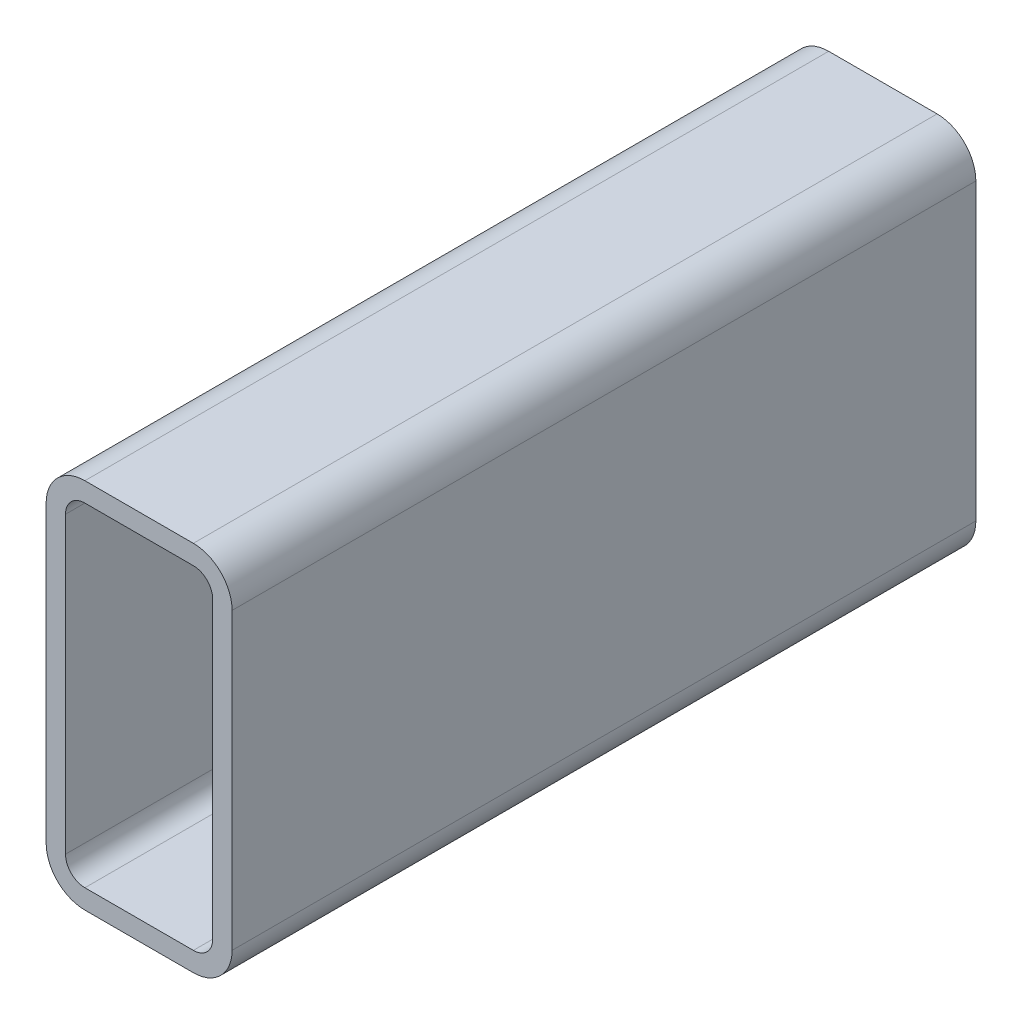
ISO-10303-21;
HEADER;
FILE_DESCRIPTION(('STEP AP214'),'2;1');
FILE_NAME('part.step','',(''),(''),'','','');
FILE_SCHEMA(('AUTOMOTIVE_DESIGN { 1 0 10303 214 1 1 1 1 }'));
ENDSEC;
DATA;
#1=APPLICATION_CONTEXT('core data for automotive mechanical design processes');
#2=APPLICATION_PROTOCOL_DEFINITION('international standard','automotive_design',2000,#1);
#3=PRODUCT_CONTEXT('',#1,'mechanical');
#4=PRODUCT('Part','Part','',(#3));
#5=PRODUCT_RELATED_PRODUCT_CATEGORY('part','',(#4));
#6=PRODUCT_DEFINITION_FORMATION('','',#4);
#7=PRODUCT_DEFINITION_CONTEXT('part definition',#1,'design');
#8=PRODUCT_DEFINITION('design','',#6,#7);
#9=PRODUCT_DEFINITION_SHAPE('','',#8);
#10=(LENGTH_UNIT() NAMED_UNIT(*) SI_UNIT(.MILLI.,.METRE.));
#11=(NAMED_UNIT(*) PLANE_ANGLE_UNIT() SI_UNIT($,.RADIAN.));
#12=(NAMED_UNIT(*) SI_UNIT($,.STERADIAN.) SOLID_ANGLE_UNIT());
#13=UNCERTAINTY_MEASURE_WITH_UNIT(LENGTH_MEASURE(1.E-05),#10,'distance_accuracy_value','');
#14=(GEOMETRIC_REPRESENTATION_CONTEXT(3) GLOBAL_UNCERTAINTY_ASSIGNED_CONTEXT((#13)) GLOBAL_UNIT_ASSIGNED_CONTEXT((#10,
#11,#12)) REPRESENTATION_CONTEXT('',''));
#15=CARTESIAN_POINT('',(0.,0.,0.));
#16=DIRECTION('',(0.,0.,1.));
#17=DIRECTION('',(1.,0.,0.));
#18=AXIS2_PLACEMENT_3D('',#15,#16,#17);
#19=CARTESIAN_POINT('',(18.3641160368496,138.536948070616,304.8));
#20=DIRECTION('',(0.,0.,1.));
#21=DIRECTION('',(1.,0.,0.));
#22=AXIS2_PLACEMENT_3D('',#19,#20,#21);
#23=PLANE('',#22);
#24=CARTESIAN_POINT('',(18.3641160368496,138.536948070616,304.8));
#25=DIRECTION('',(0.,0.,1.));
#26=DIRECTION('',(1.,0.,0.));
#27=AXIS2_PLACEMENT_3D('',#24,#25,#26);
#28=CIRCLE('',#27,15.875);
#29=CARTESIAN_POINT('',(18.3641160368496,154.411948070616,304.8));
#30=VERTEX_POINT('',#29);
#31=CARTESIAN_POINT('',(2.48911603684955,138.536948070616,304.8));
#32=VERTEX_POINT('',#31);
#33=EDGE_CURVE('E211',#30,#32,#28,.T.);
#34=ORIENTED_EDGE('',*,*,#33,.T.);
#35=DIRECTION('',(0.,-1.,0.));
#36=VECTOR('',#35,1.);
#37=CARTESIAN_POINT('',(2.48911603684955,17.8869480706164,304.8));
#38=LINE('',#37,#36);
#39=CARTESIAN_POINT('',(2.48911603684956,17.8869480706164,304.8));
#40=VERTEX_POINT('',#39);
#41=EDGE_CURVE('E214',#32,#40,#38,.T.);
#42=ORIENTED_EDGE('',*,*,#41,.T.);
#43=CARTESIAN_POINT('',(18.3641160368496,17.8869480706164,304.8));
#44=DIRECTION('',(0.,0.,1.));
#45=DIRECTION('',(1.,0.,0.));
#46=AXIS2_PLACEMENT_3D('',#43,#44,#45);
#47=CIRCLE('',#46,15.875);
#48=CARTESIAN_POINT('',(18.3641160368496,2.01194807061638,304.8));
#49=VERTEX_POINT('',#48);
#50=EDGE_CURVE('E217',#40,#49,#47,.T.);
#51=ORIENTED_EDGE('',*,*,#50,.T.);
#52=DIRECTION('',(1.,0.,0.));
#53=VECTOR('',#52,1.);
#54=CARTESIAN_POINT('',(62.8141160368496,2.01194807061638,304.8));
#55=LINE('',#54,#53);
#56=CARTESIAN_POINT('',(62.8141160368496,2.01194807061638,304.8));
#57=VERTEX_POINT('',#56);
#58=EDGE_CURVE('E219',#49,#57,#55,.T.);
#59=ORIENTED_EDGE('',*,*,#58,.T.);
#60=CARTESIAN_POINT('',(62.8141160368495,17.8869480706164,304.8));
#61=DIRECTION('',(0.,0.,1.));
#62=DIRECTION('',(1.,0.,0.));
#63=AXIS2_PLACEMENT_3D('',#60,#61,#62);
#64=CIRCLE('',#63,15.875);
#65=CARTESIAN_POINT('',(78.6891160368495,17.8869480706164,304.8));
#66=VERTEX_POINT('',#65);
#67=EDGE_CURVE('E221',#57,#66,#64,.T.);
#68=ORIENTED_EDGE('',*,*,#67,.T.);
#69=DIRECTION('',(0.,1.,0.));
#70=VECTOR('',#69,1.);
#71=CARTESIAN_POINT('',(78.6891160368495,138.536948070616,304.8));
#72=LINE('',#71,#70);
#73=CARTESIAN_POINT('',(78.6891160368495,138.536948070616,304.8));
#74=VERTEX_POINT('',#73);
#75=EDGE_CURVE('E223',#66,#74,#72,.T.);
#76=ORIENTED_EDGE('',*,*,#75,.T.);
#77=CARTESIAN_POINT('',(62.8141160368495,138.536948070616,304.8));
#78=DIRECTION('',(0.,0.,1.));
#79=DIRECTION('',(1.,0.,0.));
#80=AXIS2_PLACEMENT_3D('',#77,#78,#79);
#81=CIRCLE('',#80,15.875);
#82=CARTESIAN_POINT('',(62.8141160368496,154.411948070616,304.8));
#83=VERTEX_POINT('',#82);
#84=EDGE_CURVE('E225',#74,#83,#81,.T.);
#85=ORIENTED_EDGE('',*,*,#84,.T.);
#86=DIRECTION('',(-1.,0.,0.));
#87=VECTOR('',#86,1.);
#88=CARTESIAN_POINT('',(18.3641160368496,154.411948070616,304.8));
#89=LINE('',#88,#87);
#90=EDGE_CURVE('E227',#83,#30,#89,.T.);
#91=ORIENTED_EDGE('',*,*,#90,.T.);
#92=EDGE_LOOP('',(#34,#42,#51,#59,#68,#76,#85,#91));
#93=FACE_BOUND('',#92,.T.);
#94=DIRECTION('',(0.,-1.,0.));
#95=VECTOR('',#94,1.);
#96=CARTESIAN_POINT('',(10.4266160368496,17.8869480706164,304.8));
#97=LINE('',#96,#95);
#98=CARTESIAN_POINT('',(10.4266160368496,138.536948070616,304.8));
#99=VERTEX_POINT('',#98);
#100=CARTESIAN_POINT('',(10.4266160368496,17.8869480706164,304.8));
#101=VERTEX_POINT('',#100);
#102=EDGE_CURVE('E154',#99,#101,#97,.T.);
#103=ORIENTED_EDGE('',*,*,#102,.F.);
#104=CARTESIAN_POINT('',(18.3641160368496,138.536948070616,304.8));
#105=DIRECTION('',(0.,0.,1.));
#106=DIRECTION('',(1.,0.,0.));
#107=AXIS2_PLACEMENT_3D('',#104,#105,#106);
#108=CIRCLE('',#107,7.93750000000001);
#109=CARTESIAN_POINT('',(18.3641160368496,146.474448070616,304.8));
#110=VERTEX_POINT('',#109);
#111=EDGE_CURVE('E146',#110,#99,#108,.T.);
#112=ORIENTED_EDGE('',*,*,#111,.F.);
#113=DIRECTION('',(-1.,0.,0.));
#114=VECTOR('',#113,1.);
#115=CARTESIAN_POINT('',(18.3641160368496,146.474448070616,304.8));
#116=LINE('',#115,#114);
#117=CARTESIAN_POINT('',(62.8141160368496,146.474448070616,304.8));
#118=VERTEX_POINT('',#117);
#119=EDGE_CURVE('E179',#118,#110,#116,.T.);
#120=ORIENTED_EDGE('',*,*,#119,.F.);
#121=CARTESIAN_POINT('',(62.8141160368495,138.536948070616,304.8));
#122=DIRECTION('',(0.,0.,1.));
#123=DIRECTION('',(1.,0.,0.));
#124=AXIS2_PLACEMENT_3D('',#121,#122,#123);
#125=CIRCLE('',#124,7.93750000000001);
#126=CARTESIAN_POINT('',(70.7516160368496,138.536948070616,304.8));
#127=VERTEX_POINT('',#126);
#128=EDGE_CURVE('E177',#127,#118,#125,.T.);
#129=ORIENTED_EDGE('',*,*,#128,.F.);
#130=DIRECTION('',(0.,1.,0.));
#131=VECTOR('',#130,1.);
#132=CARTESIAN_POINT('',(70.7516160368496,138.536948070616,304.8));
#133=LINE('',#132,#131);
#134=CARTESIAN_POINT('',(70.7516160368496,17.8869480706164,304.8));
#135=VERTEX_POINT('',#134);
#136=EDGE_CURVE('E175',#135,#127,#133,.T.);
#137=ORIENTED_EDGE('',*,*,#136,.F.);
#138=CARTESIAN_POINT('',(62.8141160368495,17.8869480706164,304.8));
#139=DIRECTION('',(0.,0.,1.));
#140=DIRECTION('',(1.,0.,0.));
#141=AXIS2_PLACEMENT_3D('',#138,#139,#140);
#142=CIRCLE('',#141,7.9375);
#143=CARTESIAN_POINT('',(62.8141160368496,9.94944807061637,304.8));
#144=VERTEX_POINT('',#143);
#145=EDGE_CURVE('E173',#144,#135,#142,.T.);
#146=ORIENTED_EDGE('',*,*,#145,.F.);
#147=DIRECTION('',(1.,0.,0.));
#148=VECTOR('',#147,1.);
#149=CARTESIAN_POINT('',(62.8141160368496,9.94944807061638,304.8));
#150=LINE('',#149,#148);
#151=CARTESIAN_POINT('',(18.3641160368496,9.94944807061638,304.8));
#152=VERTEX_POINT('',#151);
#153=EDGE_CURVE('E169',#152,#144,#150,.T.);
#154=ORIENTED_EDGE('',*,*,#153,.F.);
#155=CARTESIAN_POINT('',(18.3641160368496,17.8869480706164,304.8));
#156=DIRECTION('',(0.,0.,1.));
#157=DIRECTION('',(1.,0.,0.));
#158=AXIS2_PLACEMENT_3D('',#155,#156,#157);
#159=CIRCLE('',#158,7.9375);
#160=EDGE_CURVE('E167',#101,#152,#159,.T.);
#161=ORIENTED_EDGE('',*,*,#160,.F.);
#162=EDGE_LOOP('',(#103,#112,#120,#129,#137,#146,#154,#161));
#163=FACE_BOUND('',#162,.T.);
#164=ADVANCED_FACE('F33',(#93,#163),#23,.T.);
#165=CARTESIAN_POINT('',(18.3641160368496,138.536948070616,0.));
#166=DIRECTION('',(0.,0.,1.));
#167=DIRECTION('',(1.,0.,0.));
#168=AXIS2_PLACEMENT_3D('',#165,#166,#167);
#169=PLANE('',#168);
#170=CARTESIAN_POINT('',(18.3641160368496,138.536948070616,0.));
#171=DIRECTION('',(0.,0.,1.));
#172=DIRECTION('',(1.,0.,0.));
#173=AXIS2_PLACEMENT_3D('',#170,#171,#172);
#174=CIRCLE('',#173,15.875);
#175=CARTESIAN_POINT('',(18.3641160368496,154.411948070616,0.));
#176=VERTEX_POINT('',#175);
#177=CARTESIAN_POINT('',(2.48911603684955,138.536948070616,0.));
#178=VERTEX_POINT('',#177);
#179=EDGE_CURVE('E162',#176,#178,#174,.T.);
#180=ORIENTED_EDGE('',*,*,#179,.F.);
#181=DIRECTION('',(-1.,0.,0.));
#182=VECTOR('',#181,1.);
#183=CARTESIAN_POINT('',(18.3641160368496,154.411948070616,0.));
#184=LINE('',#183,#182);
#185=CARTESIAN_POINT('',(62.8141160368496,154.411948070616,0.));
#186=VERTEX_POINT('',#185);
#187=EDGE_CURVE('E215',#186,#176,#184,.T.);
#188=ORIENTED_EDGE('',*,*,#187,.F.);
#189=CARTESIAN_POINT('',(62.8141160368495,138.536948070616,0.));
#190=DIRECTION('',(0.,0.,1.));
#191=DIRECTION('',(1.,0.,0.));
#192=AXIS2_PLACEMENT_3D('',#189,#190,#191);
#193=CIRCLE('',#192,15.875);
#194=CARTESIAN_POINT('',(78.6891160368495,138.536948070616,0.));
#195=VERTEX_POINT('',#194);
#196=EDGE_CURVE('E242',#195,#186,#193,.T.);
#197=ORIENTED_EDGE('',*,*,#196,.F.);
#198=DIRECTION('',(0.,1.,0.));
#199=VECTOR('',#198,1.);
#200=CARTESIAN_POINT('',(78.6891160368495,138.536948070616,0.));
#201=LINE('',#200,#199);
#202=CARTESIAN_POINT('',(78.6891160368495,17.8869480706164,0.));
#203=VERTEX_POINT('',#202);
#204=EDGE_CURVE('E240',#203,#195,#201,.T.);
#205=ORIENTED_EDGE('',*,*,#204,.F.);
#206=CARTESIAN_POINT('',(62.8141160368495,17.8869480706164,0.));
#207=DIRECTION('',(0.,0.,1.));
#208=DIRECTION('',(1.,0.,0.));
#209=AXIS2_PLACEMENT_3D('',#206,#207,#208);
#210=CIRCLE('',#209,15.875);
#211=CARTESIAN_POINT('',(62.8141160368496,2.01194807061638,0.));
#212=VERTEX_POINT('',#211);
#213=EDGE_CURVE('E238',#212,#203,#210,.T.);
#214=ORIENTED_EDGE('',*,*,#213,.F.);
#215=DIRECTION('',(1.,0.,0.));
#216=VECTOR('',#215,1.);
#217=CARTESIAN_POINT('',(62.8141160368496,2.01194807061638,0.));
#218=LINE('',#217,#216);
#219=CARTESIAN_POINT('',(18.3641160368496,2.01194807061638,0.));
#220=VERTEX_POINT('',#219);
#221=EDGE_CURVE('E236',#220,#212,#218,.T.);
#222=ORIENTED_EDGE('',*,*,#221,.F.);
#223=CARTESIAN_POINT('',(18.3641160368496,17.8869480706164,0.));
#224=DIRECTION('',(0.,0.,1.));
#225=DIRECTION('',(1.,0.,0.));
#226=AXIS2_PLACEMENT_3D('',#223,#224,#225);
#227=CIRCLE('',#226,15.875);
#228=CARTESIAN_POINT('',(2.48911603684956,17.8869480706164,0.));
#229=VERTEX_POINT('',#228);
#230=EDGE_CURVE('E234',#229,#220,#227,.T.);
#231=ORIENTED_EDGE('',*,*,#230,.F.);
#232=DIRECTION('',(0.,-1.,0.));
#233=VECTOR('',#232,1.);
#234=CARTESIAN_POINT('',(2.48911603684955,17.8869480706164,0.));
#235=LINE('',#234,#233);
#236=EDGE_CURVE('E232',#178,#229,#235,.T.);
#237=ORIENTED_EDGE('',*,*,#236,.F.);
#238=EDGE_LOOP('',(#180,#188,#197,#205,#214,#222,#231,#237));
#239=FACE_BOUND('',#238,.T.);
#240=CARTESIAN_POINT('',(18.3641160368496,138.536948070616,0.));
#241=DIRECTION('',(0.,0.,1.));
#242=DIRECTION('',(1.,0.,0.));
#243=AXIS2_PLACEMENT_3D('',#240,#241,#242);
#244=CIRCLE('',#243,7.93750000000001);
#245=CARTESIAN_POINT('',(18.3641160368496,146.474448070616,0.));
#246=VERTEX_POINT('',#245);
#247=CARTESIAN_POINT('',(10.4266160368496,138.536948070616,0.));
#248=VERTEX_POINT('',#247);
#249=EDGE_CURVE('E56',#246,#248,#244,.T.);
#250=ORIENTED_EDGE('',*,*,#249,.T.);
#251=DIRECTION('',(0.,-1.,0.));
#252=VECTOR('',#251,1.);
#253=CARTESIAN_POINT('',(10.4266160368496,17.8869480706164,0.));
#254=LINE('',#253,#252);
#255=CARTESIAN_POINT('',(10.4266160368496,17.8869480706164,0.));
#256=VERTEX_POINT('',#255);
#257=EDGE_CURVE('E161',#248,#256,#254,.T.);
#258=ORIENTED_EDGE('',*,*,#257,.T.);
#259=CARTESIAN_POINT('',(18.3641160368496,17.8869480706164,0.));
#260=DIRECTION('',(0.,0.,1.));
#261=DIRECTION('',(1.,0.,0.));
#262=AXIS2_PLACEMENT_3D('',#259,#260,#261);
#263=CIRCLE('',#262,7.9375);
#264=CARTESIAN_POINT('',(18.3641160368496,9.94944807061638,0.));
#265=VERTEX_POINT('',#264);
#266=EDGE_CURVE('E183',#256,#265,#263,.T.);
#267=ORIENTED_EDGE('',*,*,#266,.T.);
#268=DIRECTION('',(1.,0.,0.));
#269=VECTOR('',#268,1.);
#270=CARTESIAN_POINT('',(62.8141160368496,9.94944807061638,0.));
#271=LINE('',#270,#269);
#272=CARTESIAN_POINT('',(62.8141160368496,9.94944807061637,0.));
#273=VERTEX_POINT('',#272);
#274=EDGE_CURVE('E186',#265,#273,#271,.T.);
#275=ORIENTED_EDGE('',*,*,#274,.T.);
#276=CARTESIAN_POINT('',(62.8141160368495,17.8869480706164,0.));
#277=DIRECTION('',(0.,0.,1.));
#278=DIRECTION('',(1.,0.,0.));
#279=AXIS2_PLACEMENT_3D('',#276,#277,#278);
#280=CIRCLE('',#279,7.9375);
#281=CARTESIAN_POINT('',(70.7516160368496,17.8869480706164,0.));
#282=VERTEX_POINT('',#281);
#283=EDGE_CURVE('E189',#273,#282,#280,.T.);
#284=ORIENTED_EDGE('',*,*,#283,.T.);
#285=DIRECTION('',(0.,1.,0.));
#286=VECTOR('',#285,1.);
#287=CARTESIAN_POINT('',(70.7516160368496,138.536948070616,0.));
#288=LINE('',#287,#286);
#289=CARTESIAN_POINT('',(70.7516160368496,138.536948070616,0.));
#290=VERTEX_POINT('',#289);
#291=EDGE_CURVE('E192',#282,#290,#288,.T.);
#292=ORIENTED_EDGE('',*,*,#291,.T.);
#293=CARTESIAN_POINT('',(62.8141160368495,138.536948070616,0.));
#294=DIRECTION('',(0.,0.,1.));
#295=DIRECTION('',(1.,0.,0.));
#296=AXIS2_PLACEMENT_3D('',#293,#294,#295);
#297=CIRCLE('',#296,7.93750000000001);
#298=CARTESIAN_POINT('',(62.8141160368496,146.474448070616,0.));
#299=VERTEX_POINT('',#298);
#300=EDGE_CURVE('E195',#290,#299,#297,.T.);
#301=ORIENTED_EDGE('',*,*,#300,.T.);
#302=DIRECTION('',(-1.,0.,0.));
#303=VECTOR('',#302,1.);
#304=CARTESIAN_POINT('',(18.3641160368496,146.474448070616,0.));
#305=LINE('',#304,#303);
#306=EDGE_CURVE('E155',#299,#246,#305,.T.);
#307=ORIENTED_EDGE('',*,*,#306,.T.);
#308=EDGE_LOOP('',(#250,#258,#267,#275,#284,#292,#301,#307));
#309=FACE_BOUND('',#308,.T.);
#310=ADVANCED_FACE('F272',(#239,#309),#169,.F.);
#311=CARTESIAN_POINT('',(18.3641160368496,138.536948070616,304.8));
#312=DIRECTION('',(0.,0.,-1.));
#313=DIRECTION('',(-1.,0.,0.));
#314=AXIS2_PLACEMENT_3D('',#311,#312,#313);
#315=CYLINDRICAL_SURFACE('',#314,15.875);
#316=ORIENTED_EDGE('',*,*,#179,.T.);
#317=DIRECTION('',(0.,0.,-1.));
#318=VECTOR('',#317,1.);
#319=CARTESIAN_POINT('',(2.48911603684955,138.536948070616,304.8));
#320=LINE('',#319,#318);
#321=EDGE_CURVE('E11',#32,#178,#320,.T.);
#322=ORIENTED_EDGE('',*,*,#321,.F.);
#323=ORIENTED_EDGE('',*,*,#33,.F.);
#324=DIRECTION('',(0.,0.,-1.));
#325=VECTOR('',#324,1.);
#326=CARTESIAN_POINT('',(18.3641160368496,154.411948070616,304.8));
#327=LINE('',#326,#325);
#328=EDGE_CURVE('E229',#30,#176,#327,.T.);
#329=ORIENTED_EDGE('',*,*,#328,.T.);
#330=EDGE_LOOP('',(#316,#322,#323,#329));
#331=FACE_BOUND('',#330,.T.);
#332=ADVANCED_FACE('F35',(#331),#315,.T.);
#333=CARTESIAN_POINT('',(2.48911603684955,17.8869480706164,304.8));
#334=DIRECTION('',(1.,0.,0.));
#335=DIRECTION('',(0.,0.,-1.));
#336=AXIS2_PLACEMENT_3D('',#333,#334,#335);
#337=PLANE('',#336);
#338=ORIENTED_EDGE('',*,*,#236,.T.);
#339=DIRECTION('',(0.,0.,-1.));
#340=VECTOR('',#339,1.);
#341=CARTESIAN_POINT('',(2.48911603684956,17.8869480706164,304.8));
#342=LINE('',#341,#340);
#343=EDGE_CURVE('E41',#40,#229,#342,.T.);
#344=ORIENTED_EDGE('',*,*,#343,.F.);
#345=ORIENTED_EDGE('',*,*,#41,.F.);
#346=ORIENTED_EDGE('',*,*,#321,.T.);
#347=EDGE_LOOP('',(#338,#344,#345,#346));
#348=FACE_BOUND('',#347,.T.);
#349=ADVANCED_FACE('F289',(#348),#337,.F.);
#350=CARTESIAN_POINT('',(18.3641160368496,17.8869480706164,304.8));
#351=DIRECTION('',(0.,0.,-1.));
#352=DIRECTION('',(-1.,0.,0.));
#353=AXIS2_PLACEMENT_3D('',#350,#351,#352);
#354=CYLINDRICAL_SURFACE('',#353,15.875);
#355=ORIENTED_EDGE('',*,*,#230,.T.);
#356=DIRECTION('',(0.,0.,-1.));
#357=VECTOR('',#356,1.);
#358=CARTESIAN_POINT('',(18.3641160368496,2.01194807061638,304.8));
#359=LINE('',#358,#357);
#360=EDGE_CURVE('E259',#49,#220,#359,.T.);
#361=ORIENTED_EDGE('',*,*,#360,.F.);
#362=ORIENTED_EDGE('',*,*,#50,.F.);
#363=ORIENTED_EDGE('',*,*,#343,.T.);
#364=EDGE_LOOP('',(#355,#361,#362,#363));
#365=FACE_BOUND('',#364,.T.);
#366=ADVANCED_FACE('F266',(#365),#354,.T.);
#367=CARTESIAN_POINT('',(62.8141160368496,2.01194807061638,304.8));
#368=DIRECTION('',(0.,1.,0.));
#369=DIRECTION('',(0.,0.,1.));
#370=AXIS2_PLACEMENT_3D('',#367,#368,#369);
#371=PLANE('',#370);
#372=ORIENTED_EDGE('',*,*,#221,.T.);
#373=DIRECTION('',(0.,0.,-1.));
#374=VECTOR('',#373,1.);
#375=CARTESIAN_POINT('',(62.8141160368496,2.01194807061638,304.8));
#376=LINE('',#375,#374);
#377=EDGE_CURVE('E256',#57,#212,#376,.T.);
#378=ORIENTED_EDGE('',*,*,#377,.F.);
#379=ORIENTED_EDGE('',*,*,#58,.F.);
#380=ORIENTED_EDGE('',*,*,#360,.T.);
#381=EDGE_LOOP('',(#372,#378,#379,#380));
#382=FACE_BOUND('',#381,.T.);
#383=ADVANCED_FACE('F278',(#382),#371,.F.);
#384=CARTESIAN_POINT('',(62.8141160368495,17.8869480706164,304.8));
#385=DIRECTION('',(0.,0.,-1.));
#386=DIRECTION('',(-1.,0.,0.));
#387=AXIS2_PLACEMENT_3D('',#384,#385,#386);
#388=CYLINDRICAL_SURFACE('',#387,15.875);
#389=ORIENTED_EDGE('',*,*,#213,.T.);
#390=DIRECTION('',(0.,0.,-1.));
#391=VECTOR('',#390,1.);
#392=CARTESIAN_POINT('',(78.6891160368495,17.8869480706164,304.8));
#393=LINE('',#392,#391);
#394=EDGE_CURVE('E253',#66,#203,#393,.T.);
#395=ORIENTED_EDGE('',*,*,#394,.F.);
#396=ORIENTED_EDGE('',*,*,#67,.F.);
#397=ORIENTED_EDGE('',*,*,#377,.T.);
#398=EDGE_LOOP('',(#389,#395,#396,#397));
#399=FACE_BOUND('',#398,.T.);
#400=ADVANCED_FACE('F282',(#399),#388,.T.);
#401=CARTESIAN_POINT('',(78.6891160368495,138.536948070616,304.8));
#402=DIRECTION('',(-1.,0.,0.));
#403=DIRECTION('',(0.,0.,1.));
#404=AXIS2_PLACEMENT_3D('',#401,#402,#403);
#405=PLANE('',#404);
#406=ORIENTED_EDGE('',*,*,#204,.T.);
#407=DIRECTION('',(0.,0.,-1.));
#408=VECTOR('',#407,1.);
#409=CARTESIAN_POINT('',(78.6891160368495,138.536948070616,304.8));
#410=LINE('',#409,#408);
#411=EDGE_CURVE('E250',#74,#195,#410,.T.);
#412=ORIENTED_EDGE('',*,*,#411,.F.);
#413=ORIENTED_EDGE('',*,*,#75,.F.);
#414=ORIENTED_EDGE('',*,*,#394,.T.);
#415=EDGE_LOOP('',(#406,#412,#413,#414));
#416=FACE_BOUND('',#415,.T.);
#417=ADVANCED_FACE('F302',(#416),#405,.F.);
#418=CARTESIAN_POINT('',(62.8141160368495,138.536948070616,304.8));
#419=DIRECTION('',(0.,0.,-1.));
#420=DIRECTION('',(-1.,0.,0.));
#421=AXIS2_PLACEMENT_3D('',#418,#419,#420);
#422=CYLINDRICAL_SURFACE('',#421,15.875);
#423=ORIENTED_EDGE('',*,*,#196,.T.);
#424=DIRECTION('',(0.,0.,-1.));
#425=VECTOR('',#424,1.);
#426=CARTESIAN_POINT('',(62.8141160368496,154.411948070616,304.8));
#427=LINE('',#426,#425);
#428=EDGE_CURVE('E247',#83,#186,#427,.T.);
#429=ORIENTED_EDGE('',*,*,#428,.F.);
#430=ORIENTED_EDGE('',*,*,#84,.F.);
#431=ORIENTED_EDGE('',*,*,#411,.T.);
#432=EDGE_LOOP('',(#423,#429,#430,#431));
#433=FACE_BOUND('',#432,.T.);
#434=ADVANCED_FACE('F300',(#433),#422,.T.);
#435=CARTESIAN_POINT('',(18.3641160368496,154.411948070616,304.8));
#436=DIRECTION('',(0.,-1.,0.));
#437=DIRECTION('',(0.,0.,-1.));
#438=AXIS2_PLACEMENT_3D('',#435,#436,#437);
#439=PLANE('',#438);
#440=ORIENTED_EDGE('',*,*,#187,.T.);
#441=ORIENTED_EDGE('',*,*,#328,.F.);
#442=ORIENTED_EDGE('',*,*,#90,.F.);
#443=ORIENTED_EDGE('',*,*,#428,.T.);
#444=EDGE_LOOP('',(#440,#441,#442,#443));
#445=FACE_BOUND('',#444,.T.);
#446=ADVANCED_FACE('F295',(#445),#439,.F.);
#447=CARTESIAN_POINT('',(18.3641160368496,138.536948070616,304.8));
#448=DIRECTION('',(0.,0.,-1.));
#449=DIRECTION('',(-1.,0.,0.));
#450=AXIS2_PLACEMENT_3D('',#447,#448,#449);
#451=CYLINDRICAL_SURFACE('',#450,7.93750000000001);
#452=ORIENTED_EDGE('',*,*,#249,.F.);
#453=DIRECTION('',(0.,0.,-1.));
#454=VECTOR('',#453,1.);
#455=CARTESIAN_POINT('',(18.3641160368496,146.474448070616,304.8));
#456=LINE('',#455,#454);
#457=EDGE_CURVE('E150',#110,#246,#456,.T.);
#458=ORIENTED_EDGE('',*,*,#457,.F.);
#459=ORIENTED_EDGE('',*,*,#111,.T.);
#460=DIRECTION('',(0.,0.,-1.));
#461=VECTOR('',#460,1.);
#462=CARTESIAN_POINT('',(10.4266160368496,138.536948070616,304.8));
#463=LINE('',#462,#461);
#464=EDGE_CURVE('E149',#99,#248,#463,.T.);
#465=ORIENTED_EDGE('',*,*,#464,.T.);
#466=EDGE_LOOP('',(#452,#458,#459,#465));
#467=FACE_BOUND('',#466,.T.);
#468=ADVANCED_FACE('F148',(#467),#451,.F.);
#469=CARTESIAN_POINT('',(10.4266160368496,17.8869480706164,304.8));
#470=DIRECTION('',(1.,0.,0.));
#471=DIRECTION('',(0.,0.,-1.));
#472=AXIS2_PLACEMENT_3D('',#469,#470,#471);
#473=PLANE('',#472);
#474=ORIENTED_EDGE('',*,*,#257,.F.);
#475=ORIENTED_EDGE('',*,*,#464,.F.);
#476=ORIENTED_EDGE('',*,*,#102,.T.);
#477=DIRECTION('',(0.,0.,-1.));
#478=VECTOR('',#477,1.);
#479=CARTESIAN_POINT('',(10.4266160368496,17.8869480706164,304.8));
#480=LINE('',#479,#478);
#481=EDGE_CURVE('E163',#101,#256,#480,.T.);
#482=ORIENTED_EDGE('',*,*,#481,.T.);
#483=EDGE_LOOP('',(#474,#475,#476,#482));
#484=FACE_BOUND('',#483,.T.);
#485=ADVANCED_FACE('F158',(#484),#473,.T.);
#486=CARTESIAN_POINT('',(18.3641160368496,17.8869480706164,304.8));
#487=DIRECTION('',(0.,0.,-1.));
#488=DIRECTION('',(-1.,0.,0.));
#489=AXIS2_PLACEMENT_3D('',#486,#487,#488);
#490=CYLINDRICAL_SURFACE('',#489,7.9375);
#491=ORIENTED_EDGE('',*,*,#266,.F.);
#492=ORIENTED_EDGE('',*,*,#481,.F.);
#493=ORIENTED_EDGE('',*,*,#160,.T.);
#494=DIRECTION('',(0.,0.,-1.));
#495=VECTOR('',#494,1.);
#496=CARTESIAN_POINT('',(18.3641160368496,9.94944807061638,304.8));
#497=LINE('',#496,#495);
#498=EDGE_CURVE('E208',#152,#265,#497,.T.);
#499=ORIENTED_EDGE('',*,*,#498,.T.);
#500=EDGE_LOOP('',(#491,#492,#493,#499));
#501=FACE_BOUND('',#500,.T.);
#502=ADVANCED_FACE('F327',(#501),#490,.F.);
#503=CARTESIAN_POINT('',(62.8141160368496,9.94944807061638,304.8));
#504=DIRECTION('',(0.,1.,0.));
#505=DIRECTION('',(0.,0.,1.));
#506=AXIS2_PLACEMENT_3D('',#503,#504,#505);
#507=PLANE('',#506);
#508=ORIENTED_EDGE('',*,*,#274,.F.);
#509=ORIENTED_EDGE('',*,*,#498,.F.);
#510=ORIENTED_EDGE('',*,*,#153,.T.);
#511=DIRECTION('',(0.,0.,-1.));
#512=VECTOR('',#511,1.);
#513=CARTESIAN_POINT('',(62.8141160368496,9.94944807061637,304.8));
#514=LINE('',#513,#512);
#515=EDGE_CURVE('E206',#144,#273,#514,.T.);
#516=ORIENTED_EDGE('',*,*,#515,.T.);
#517=EDGE_LOOP('',(#508,#509,#510,#516));
#518=FACE_BOUND('',#517,.T.);
#519=ADVANCED_FACE('F331',(#518),#507,.T.);
#520=CARTESIAN_POINT('',(62.8141160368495,17.8869480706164,304.8));
#521=DIRECTION('',(0.,0.,-1.));
#522=DIRECTION('',(-1.,0.,0.));
#523=AXIS2_PLACEMENT_3D('',#520,#521,#522);
#524=CYLINDRICAL_SURFACE('',#523,7.9375);
#525=ORIENTED_EDGE('',*,*,#283,.F.);
#526=ORIENTED_EDGE('',*,*,#515,.F.);
#527=ORIENTED_EDGE('',*,*,#145,.T.);
#528=DIRECTION('',(0.,0.,-1.));
#529=VECTOR('',#528,1.);
#530=CARTESIAN_POINT('',(70.7516160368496,17.8869480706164,304.8));
#531=LINE('',#530,#529);
#532=EDGE_CURVE('E204',#135,#282,#531,.T.);
#533=ORIENTED_EDGE('',*,*,#532,.T.);
#534=EDGE_LOOP('',(#525,#526,#527,#533));
#535=FACE_BOUND('',#534,.T.);
#536=ADVANCED_FACE('F337',(#535),#524,.F.);
#537=CARTESIAN_POINT('',(70.7516160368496,138.536948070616,304.8));
#538=DIRECTION('',(-1.,0.,0.));
#539=DIRECTION('',(0.,0.,1.));
#540=AXIS2_PLACEMENT_3D('',#537,#538,#539);
#541=PLANE('',#540);
#542=ORIENTED_EDGE('',*,*,#291,.F.);
#543=ORIENTED_EDGE('',*,*,#532,.F.);
#544=ORIENTED_EDGE('',*,*,#136,.T.);
#545=DIRECTION('',(0.,0.,-1.));
#546=VECTOR('',#545,1.);
#547=CARTESIAN_POINT('',(70.7516160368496,138.536948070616,304.8));
#548=LINE('',#547,#546);
#549=EDGE_CURVE('E202',#127,#290,#548,.T.);
#550=ORIENTED_EDGE('',*,*,#549,.T.);
#551=EDGE_LOOP('',(#542,#543,#544,#550));
#552=FACE_BOUND('',#551,.T.);
#553=ADVANCED_FACE('F341',(#552),#541,.T.);
#554=CARTESIAN_POINT('',(62.8141160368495,138.536948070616,304.8));
#555=DIRECTION('',(0.,0.,-1.));
#556=DIRECTION('',(-1.,0.,0.));
#557=AXIS2_PLACEMENT_3D('',#554,#555,#556);
#558=CYLINDRICAL_SURFACE('',#557,7.93750000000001);
#559=ORIENTED_EDGE('',*,*,#300,.F.);
#560=ORIENTED_EDGE('',*,*,#549,.F.);
#561=ORIENTED_EDGE('',*,*,#128,.T.);
#562=DIRECTION('',(0.,0.,-1.));
#563=VECTOR('',#562,1.);
#564=CARTESIAN_POINT('',(62.8141160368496,146.474448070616,304.8));
#565=LINE('',#564,#563);
#566=EDGE_CURVE('E48',#118,#299,#565,.T.);
#567=ORIENTED_EDGE('',*,*,#566,.T.);
#568=EDGE_LOOP('',(#559,#560,#561,#567));
#569=FACE_BOUND('',#568,.T.);
#570=ADVANCED_FACE('F345',(#569),#558,.F.);
#571=CARTESIAN_POINT('',(18.3641160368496,146.474448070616,304.8));
#572=DIRECTION('',(0.,-1.,0.));
#573=DIRECTION('',(0.,0.,-1.));
#574=AXIS2_PLACEMENT_3D('',#571,#572,#573);
#575=PLANE('',#574);
#576=ORIENTED_EDGE('',*,*,#306,.F.);
#577=ORIENTED_EDGE('',*,*,#566,.F.);
#578=ORIENTED_EDGE('',*,*,#119,.T.);
#579=ORIENTED_EDGE('',*,*,#457,.T.);
#580=EDGE_LOOP('',(#576,#577,#578,#579));
#581=FACE_BOUND('',#580,.T.);
#582=ADVANCED_FACE('F349',(#581),#575,.T.);
#583=CLOSED_SHELL('',(#164,#310,#332,#349,#366,#383,#400,#417,#434,#446,#468,#485,#502,#519,
#536,#553,#570,#582));
#584=MANIFOLD_SOLID_BREP('B2',#583);
#585=ADVANCED_BREP_SHAPE_REPRESENTATION('',(#18,#584),#14);
#586=SHAPE_DEFINITION_REPRESENTATION(#9,#585);
ENDSEC;
END-ISO-10303-21;
